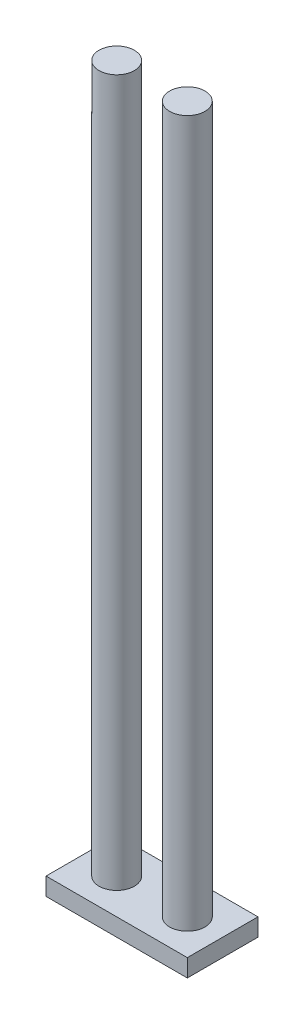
from build123d import *

# Parameters (mm, degrees)
SKETCH1_R             = 5
BOSS_EXTRUDE1_DEPTH   = 200
BOSS_EXTRUDE1_2_DEPTH = 200
SKETCH2_W             = 40
SKETCH2_H             = 20
BOSS_EXTRUDE2_DEPTH   = 5


with BuildPart() as part:
    # Sketch1 → Boss-Extrude1 (new body)
    with BuildSketch(Plane(origin=(0, 0, 0), x_dir=(1, 0, 0), z_dir=(0, 1, 0))):
        with Locations(Location((0, 0, 0), (0, 0, 270))):
            Circle(SKETCH1_R)
    extrude(amount=BOSS_EXTRUDE1_DEPTH)



with BuildPart() as body_2:
    # Sketch1 → Boss-Extrude1 2 (new body)
    with BuildSketch(Plane(origin=(0, 0, 0), x_dir=(1, 0, 0), z_dir=(0, 1, 0))):
        with Locations(Location((-20, 0, 0), (0, 0, 270))):
            Circle(SKETCH1_R)
    extrude(amount=BOSS_EXTRUDE1_2_DEPTH)


with BuildPart() as part_1:
    add(part.part)

    add(body_2.part)  # Boss-Extrude2 merges body 2
    # Sketch2 → Boss-Extrude2 (add)
    with BuildSketch(Plane(origin=(0, 0, 0), x_dir=(1, 0, 0), z_dir=(0, 1, 0))):
        with Locations((-10, 0)):
            Rectangle(SKETCH2_W, SKETCH2_H)
    extrude(amount=-BOSS_EXTRUDE2_DEPTH)


solid = part_1.part
